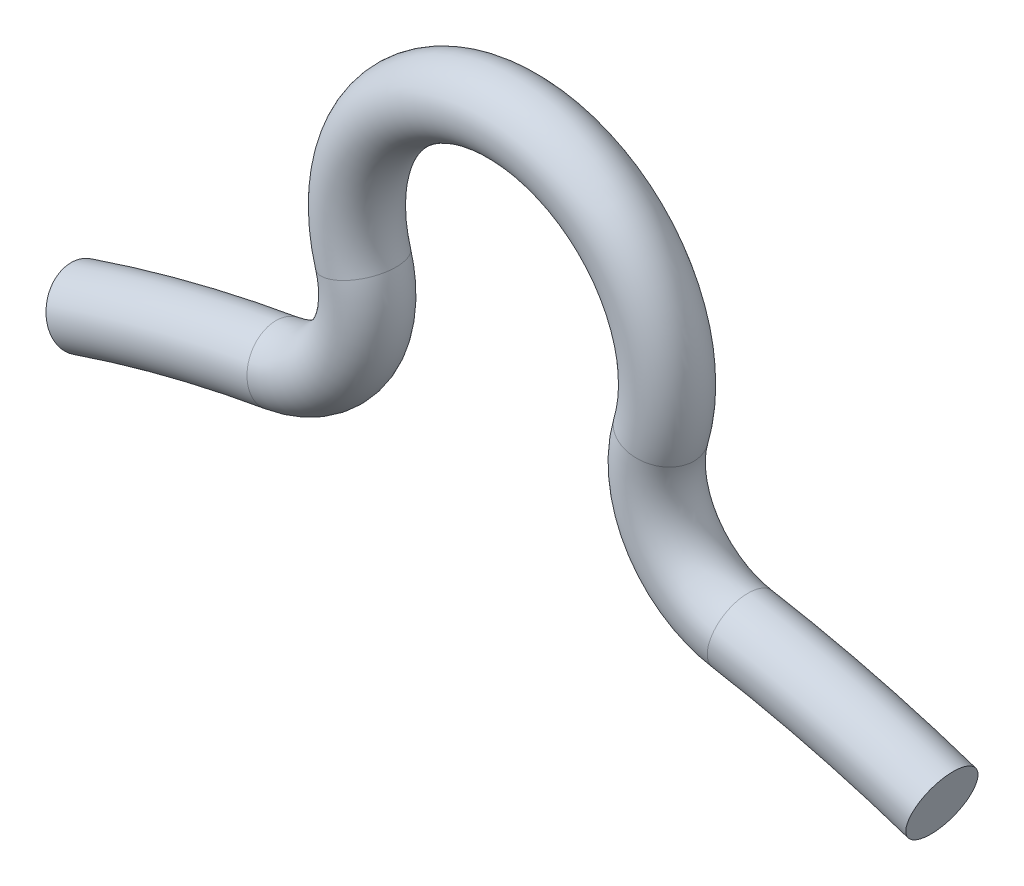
from build123d import *

# Parameters (mm, degrees)
ESQUISSE2_R = 10


with BuildPart() as part:
    # Balayage1: sweep along a path in Esquisse1
    with BuildLine(Plane.XY) as balayage1_path:
        ThreePointArc((-125, 369.425229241), (-96.241051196, 377.938698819), (-66.912909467, 384.21694724))
        ThreePointArc((-66.912909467, 384.21694724), (-46.587592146, 397.924271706), (-43.272482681, 422.214584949))
        ThreePointArc((-43.272482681, 422.214584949), (0, 480), (43.272482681, 422.214584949))
        ThreePointArc((43.272482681, 422.214584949), (46.587592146, 397.924271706), (66.912909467, 384.21694724))
        ThreePointArc((66.912909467, 384.21694724), (96.241051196, 377.938698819), (125, 369.425229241))
    # Esquisse2 → Balayage1 (sweep)
    with BuildSketch(Plane(origin=(-125, 369.425229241, 0), x_dir=(0, 0, -1), z_dir=(0.9472441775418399, 0.32051282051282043, 0))):
        Circle(ESQUISSE2_R)
    sweep(path=balayage1_path.line)


solid = part.part
